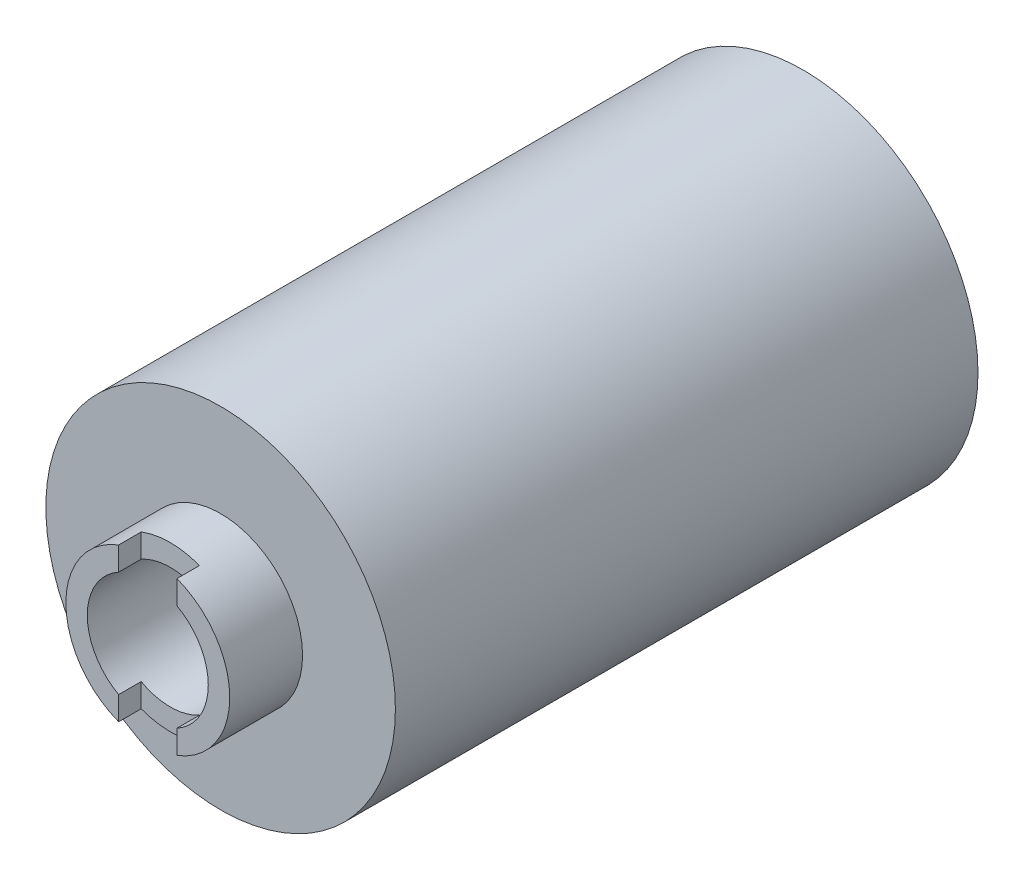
from build123d import *

# Parameters (mm, degrees)
ESQUISSE1_R                  = 60
BOSS_EXTRU_1_DEPTH           = 200
ESQUISSE2_R                  = 28.129311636
BOSS_EXTRU_2_DEPTH           = 25
ESQUISSE3_R                  = 20.7635893
ENL_V_MAT_EXTRU_1_DEPTH      = 241.468293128
ENL_V_MAT_EXTRU_2_DEPTH      = 241.468293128
ENL_V_MAT_EXTRU_2_DEPTH_BACK = 241.468293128
ESQUISSE4_W                  = 20
ESQUISSE4_H                  = 23.215211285


with BuildPart() as part:
    # Esquisse1 → Boss.-Extru.1 (new body)
    with BuildSketch(Plane.XY):
        Circle(ESQUISSE1_R)
    extrude(amount=BOSS_EXTRU_1_DEPTH)

    # Esquisse2 → Boss.-Extru.2 (add)
    with BuildSketch(Plane.XY.offset(200)):
        Circle(ESQUISSE2_R)
    extrude(amount=BOSS_EXTRU_2_DEPTH)

    # Esquisse3 → Enl_v. mat.-Extru.1 (cut, through all)
    with BuildSketch(Plane.XY.offset(225)):
        Circle(ESQUISSE3_R)
    extrude(amount=-ENL_V_MAT_EXTRU_1_DEPTH, mode=Mode.SUBTRACT)

    # Esquisse4 → Enl_v. mat.-Extru.2 (cut, two sides: drawn at the far end of the back side and taken through both)
    with BuildSketch(Plane(origin=(0, 0, 0), x_dir=(1, 0, 0), z_dir=(0, 1, 0)).offset(-ENL_V_MAT_EXTRU_2_DEPTH_BACK)):
        with Locations((0, -228.870814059)):
            Rectangle(ESQUISSE4_W, ESQUISSE4_H)
    extrude(amount=ENL_V_MAT_EXTRU_2_DEPTH + ENL_V_MAT_EXTRU_2_DEPTH_BACK, mode=Mode.SUBTRACT)


solid = part.part
